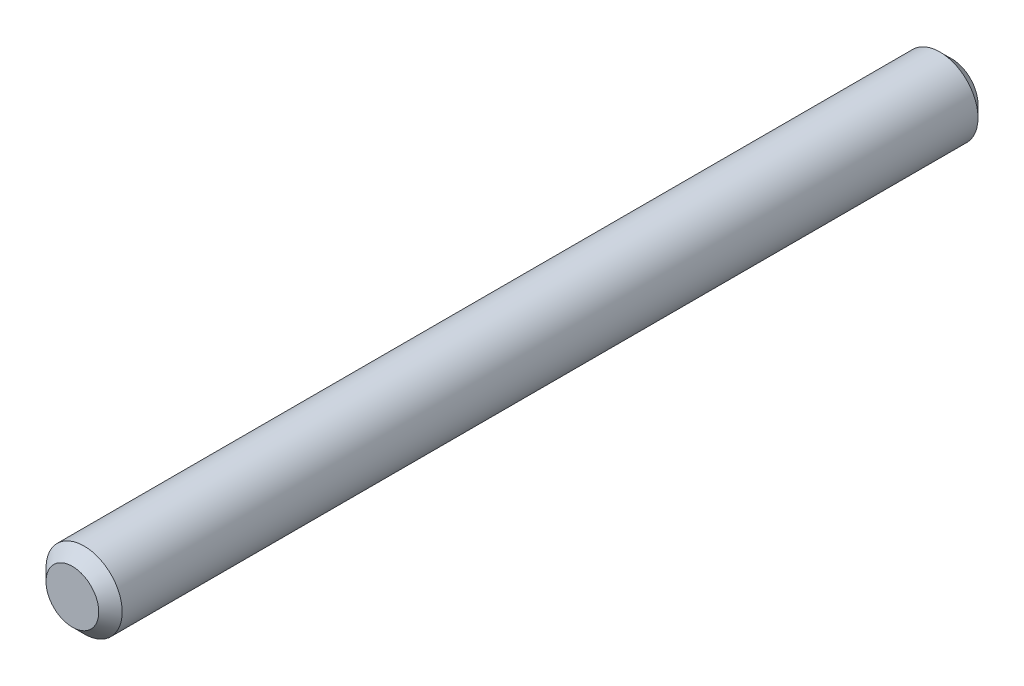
ISO-10303-21;
HEADER;
FILE_DESCRIPTION(('STEP AP214'),'2;1');
FILE_NAME('part.step','',(''),(''),'','','');
FILE_SCHEMA(('AUTOMOTIVE_DESIGN { 1 0 10303 214 1 1 1 1 }'));
ENDSEC;
DATA;
#1=APPLICATION_CONTEXT('core data for automotive mechanical design processes');
#2=APPLICATION_PROTOCOL_DEFINITION('international standard','automotive_design',2000,#1);
#3=PRODUCT_CONTEXT('',#1,'mechanical');
#4=PRODUCT('Part','Part','',(#3));
#5=PRODUCT_RELATED_PRODUCT_CATEGORY('part','',(#4));
#6=PRODUCT_DEFINITION_FORMATION('','',#4);
#7=PRODUCT_DEFINITION_CONTEXT('part definition',#1,'design');
#8=PRODUCT_DEFINITION('design','',#6,#7);
#9=PRODUCT_DEFINITION_SHAPE('','',#8);
#10=(LENGTH_UNIT() NAMED_UNIT(*) SI_UNIT(.MILLI.,.METRE.));
#11=(NAMED_UNIT(*) PLANE_ANGLE_UNIT() SI_UNIT($,.RADIAN.));
#12=(NAMED_UNIT(*) SI_UNIT($,.STERADIAN.) SOLID_ANGLE_UNIT());
#13=UNCERTAINTY_MEASURE_WITH_UNIT(LENGTH_MEASURE(1.E-05),#10,'distance_accuracy_value','');
#14=(GEOMETRIC_REPRESENTATION_CONTEXT(3) GLOBAL_UNCERTAINTY_ASSIGNED_CONTEXT((#13)) GLOBAL_UNIT_ASSIGNED_CONTEXT((#10,
#11,#12)) REPRESENTATION_CONTEXT('',''));
#15=CARTESIAN_POINT('',(0.,0.,0.));
#16=DIRECTION('',(0.,0.,1.));
#17=DIRECTION('',(1.,0.,0.));
#18=AXIS2_PLACEMENT_3D('',#15,#16,#17);
#19=CARTESIAN_POINT('',(0.,0.,15.));
#20=DIRECTION('',(0.,0.,-1.));
#21=DIRECTION('',(-1.,0.,0.));
#22=AXIS2_PLACEMENT_3D('',#19,#20,#21);
#23=CYLINDRICAL_SURFACE('',#22,0.65);
#24=CARTESIAN_POINT('',(0.,0.,14.8));
#25=DIRECTION('',(0.,0.,1.));
#26=DIRECTION('',(1.,0.,0.));
#27=AXIS2_PLACEMENT_3D('',#24,#25,#26);
#28=CIRCLE('',#27,0.65);
#29=CARTESIAN_POINT('',(0.65,0.,14.8));
#30=VERTEX_POINT('',#29);
#31=EDGE_CURVE('E31',#30,#30,#28,.F.);
#32=ORIENTED_EDGE('',*,*,#31,.T.);
#33=EDGE_LOOP('',(#32));
#34=FACE_BOUND('',#33,.T.);
#35=CARTESIAN_POINT('',(0.,0.,0.200000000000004));
#36=DIRECTION('',(0.,0.,1.));
#37=DIRECTION('',(1.,0.,0.));
#38=AXIS2_PLACEMENT_3D('',#35,#36,#37);
#39=CIRCLE('',#38,0.65);
#40=CARTESIAN_POINT('',(0.65,0.,0.200000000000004));
#41=VERTEX_POINT('',#40);
#42=EDGE_CURVE('E35',#41,#41,#39,.T.);
#43=ORIENTED_EDGE('',*,*,#42,.T.);
#44=EDGE_LOOP('',(#43));
#45=FACE_BOUND('',#44,.T.);
#46=ADVANCED_FACE('F25',(#34,#45),#23,.T.);
#47=CARTESIAN_POINT('',(0.,0.,15.));
#48=DIRECTION('',(0.,0.,1.));
#49=DIRECTION('',(1.,0.,0.));
#50=AXIS2_PLACEMENT_3D('',#47,#48,#49);
#51=PLANE('',#50);
#52=CARTESIAN_POINT('',(0.,0.,15.));
#53=DIRECTION('',(0.,0.,1.));
#54=DIRECTION('',(1.,0.,0.));
#55=AXIS2_PLACEMENT_3D('',#52,#53,#54);
#56=CIRCLE('',#55,0.449999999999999);
#57=CARTESIAN_POINT('',(0.449999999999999,0.,15.));
#58=VERTEX_POINT('',#57);
#59=EDGE_CURVE('E39',#58,#58,#56,.T.);
#60=ORIENTED_EDGE('',*,*,#59,.T.);
#61=EDGE_LOOP('',(#60));
#62=FACE_BOUND('',#61,.T.);
#63=ADVANCED_FACE('F45',(#62),#51,.T.);
#64=CARTESIAN_POINT('',(0.,0.,0.));
#65=DIRECTION('',(0.,0.,1.));
#66=DIRECTION('',(1.,0.,0.));
#67=AXIS2_PLACEMENT_3D('',#64,#65,#66);
#68=PLANE('',#67);
#69=CARTESIAN_POINT('',(0.,0.,0.));
#70=DIRECTION('',(0.,0.,1.));
#71=DIRECTION('',(1.,0.,0.));
#72=AXIS2_PLACEMENT_3D('',#69,#70,#71);
#73=CIRCLE('',#72,0.449999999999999);
#74=CARTESIAN_POINT('',(0.449999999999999,0.,0.));
#75=VERTEX_POINT('',#74);
#76=EDGE_CURVE('E10',#75,#75,#73,.F.);
#77=ORIENTED_EDGE('',*,*,#76,.T.);
#78=EDGE_LOOP('',(#77));
#79=FACE_BOUND('',#78,.T.);
#80=ADVANCED_FACE('F50',(#79),#68,.F.);
#81=CARTESIAN_POINT('',(0.,0.,15.));
#82=DIRECTION('',(0.,0.,-1.));
#83=DIRECTION('',(-1.,0.,0.));
#84=AXIS2_PLACEMENT_3D('',#81,#82,#83);
#85=CONICAL_SURFACE('',#84,0.449999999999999,0.785398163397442);
#86=ORIENTED_EDGE('',*,*,#31,.F.);
#87=EDGE_LOOP('',(#86));
#88=FACE_BOUND('',#87,.T.);
#89=ORIENTED_EDGE('',*,*,#59,.F.);
#90=EDGE_LOOP('',(#89));
#91=FACE_BOUND('',#90,.T.);
#92=ADVANCED_FACE('F47',(#88,#91),#85,.T.);
#93=CARTESIAN_POINT('',(0.,0.,0.200000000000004));
#94=DIRECTION('',(0.,0.,1.));
#95=DIRECTION('',(1.,0.,0.));
#96=AXIS2_PLACEMENT_3D('',#93,#94,#95);
#97=CONICAL_SURFACE('',#96,0.65,0.785398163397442);
#98=ORIENTED_EDGE('',*,*,#76,.F.);
#99=EDGE_LOOP('',(#98));
#100=FACE_BOUND('',#99,.T.);
#101=ORIENTED_EDGE('',*,*,#42,.F.);
#102=EDGE_LOOP('',(#101));
#103=FACE_BOUND('',#102,.T.);
#104=ADVANCED_FACE('F49',(#100,#103),#97,.T.);
#105=CLOSED_SHELL('',(#46,#63,#80,#92,#104));
#106=MANIFOLD_SOLID_BREP('B2',#105);
#107=ADVANCED_BREP_SHAPE_REPRESENTATION('',(#18,#106),#14);
#108=SHAPE_DEFINITION_REPRESENTATION(#9,#107);
ENDSEC;
END-ISO-10303-21;
